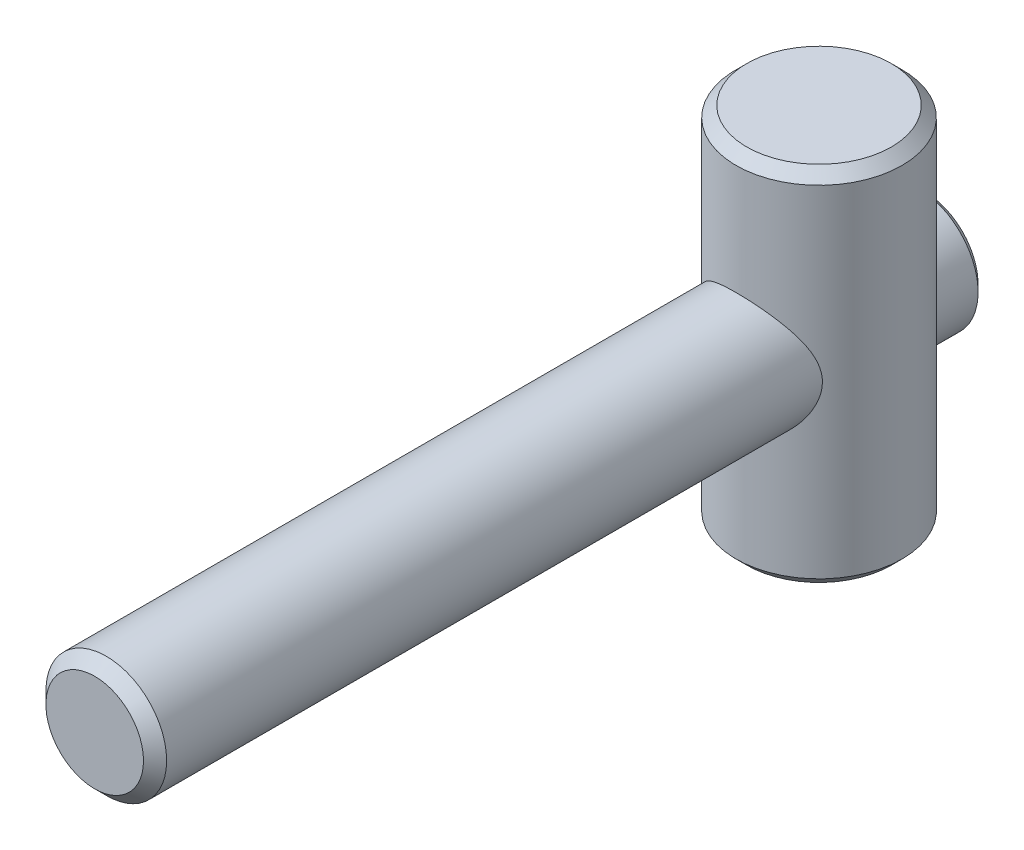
ISO-10303-21;
HEADER;
FILE_DESCRIPTION(('STEP AP214'),'2;1');
FILE_NAME('part.step','',(''),(''),'','','');
FILE_SCHEMA(('AUTOMOTIVE_DESIGN { 1 0 10303 214 1 1 1 1 }'));
ENDSEC;
DATA;
#1=APPLICATION_CONTEXT('core data for automotive mechanical design processes');
#2=APPLICATION_PROTOCOL_DEFINITION('international standard','automotive_design',2000,#1);
#3=PRODUCT_CONTEXT('',#1,'mechanical');
#4=PRODUCT('Part','Part','',(#3));
#5=PRODUCT_RELATED_PRODUCT_CATEGORY('part','',(#4));
#6=PRODUCT_DEFINITION_FORMATION('','',#4);
#7=PRODUCT_DEFINITION_CONTEXT('part definition',#1,'design');
#8=PRODUCT_DEFINITION('design','',#6,#7);
#9=PRODUCT_DEFINITION_SHAPE('','',#8);
#10=(LENGTH_UNIT() NAMED_UNIT(*) SI_UNIT(.MILLI.,.METRE.));
#11=(NAMED_UNIT(*) PLANE_ANGLE_UNIT() SI_UNIT($,.RADIAN.));
#12=(NAMED_UNIT(*) SI_UNIT($,.STERADIAN.) SOLID_ANGLE_UNIT());
#13=UNCERTAINTY_MEASURE_WITH_UNIT(LENGTH_MEASURE(1.E-05),#10,'distance_accuracy_value','');
#14=(GEOMETRIC_REPRESENTATION_CONTEXT(3) GLOBAL_UNCERTAINTY_ASSIGNED_CONTEXT((#13)) GLOBAL_UNIT_ASSIGNED_CONTEXT((#10,
#11,#12)) REPRESENTATION_CONTEXT('',''));
#15=CARTESIAN_POINT('',(0.,0.,0.));
#16=DIRECTION('',(0.,0.,1.));
#17=DIRECTION('',(1.,0.,0.));
#18=AXIS2_PLACEMENT_3D('',#15,#16,#17);
#19=CARTESIAN_POINT('',(0.,0.,-25.3));
#20=DIRECTION('',(0.,0.,1.));
#21=DIRECTION('',(1.,0.,0.));
#22=AXIS2_PLACEMENT_3D('',#19,#20,#21);
#23=PLANE('',#22);
#24=CARTESIAN_POINT('',(0.,0.,-25.3));
#25=DIRECTION('',(0.,0.,1.));
#26=DIRECTION('',(1.,0.,0.));
#27=AXIS2_PLACEMENT_3D('',#24,#25,#26);
#28=CIRCLE('',#27,3.54);
#29=CARTESIAN_POINT('',(-0.6,3.48878202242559,-25.3));
#30=VERTEX_POINT('',#29);
#31=CARTESIAN_POINT('',(-0.6,-3.48878202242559,-25.3));
#32=VERTEX_POINT('',#31);
#33=EDGE_CURVE('E239',#30,#32,#28,.T.);
#34=ORIENTED_EDGE('',*,*,#33,.F.);
#35=DIRECTION('',(0.,-1.,0.));
#36=VECTOR('',#35,1.);
#37=CARTESIAN_POINT('',(-0.6,0.,-25.3));
#38=LINE('',#37,#36);
#39=EDGE_CURVE('E228',#30,#32,#38,.T.);
#40=ORIENTED_EDGE('',*,*,#39,.T.);
#41=EDGE_LOOP('',(#34,#40));
#42=FACE_BOUND('',#41,.T.);
#43=ADVANCED_FACE('F14',(#42),#23,.F.);
#44=CARTESIAN_POINT('',(0.,0.,-25.3));
#45=DIRECTION('',(0.,0.,1.));
#46=DIRECTION('',(1.,0.,0.));
#47=AXIS2_PLACEMENT_3D('',#44,#45,#46);
#48=CONICAL_SURFACE('',#47,3.54,0.785398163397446);
#49=CARTESIAN_POINT('',(0.,0.,-24.84));
#50=DIRECTION('',(0.,0.,1.));
#51=DIRECTION('',(1.,0.,0.));
#52=AXIS2_PLACEMENT_3D('',#49,#50,#51);
#53=CIRCLE('',#52,4.);
#54=CARTESIAN_POINT('',(-0.6,3.95474398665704,-24.84));
#55=VERTEX_POINT('',#54);
#56=CARTESIAN_POINT('',(-0.6,-3.95474398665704,-24.84));
#57=VERTEX_POINT('',#56);
#58=EDGE_CURVE('E235',#55,#57,#53,.T.);
#59=ORIENTED_EDGE('',*,*,#58,.F.);
#60=CARTESIAN_POINT('',(-0.6,3.9554519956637,-24.8393));
#61=CARTESIAN_POINT('',(-0.6,3.83941046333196,-24.9540237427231));
#62=CARTESIAN_POINT('',(-0.6,3.72331727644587,-25.0686953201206));
#63=CARTESIAN_POINT('',(-0.6,3.49091447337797,-25.2979511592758));
#64=CARTESIAN_POINT('',(-0.6,3.37460477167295,-25.4125353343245));
#65=CARTESIAN_POINT('',(-0.6,3.14054409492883,-25.642725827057));
#66=CARTESIAN_POINT('',(-0.6,3.02279099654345,-25.7583299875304));
#67=CARTESIAN_POINT('',(-0.6,2.78706506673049,-25.9891808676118));
#68=CARTESIAN_POINT('',(-0.6,2.66909239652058,-26.1044277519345));
#69=CARTESIAN_POINT('',(-0.6,2.38769992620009,-26.3783597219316));
#70=CARTESIAN_POINT('',(-0.6,2.2240974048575,-26.536857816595));
#71=CARTESIAN_POINT('',(-0.6,1.97745696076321,-26.7736454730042));
#72=CARTESIAN_POINT('',(-0.6,1.89495476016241,-26.8524926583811));
#73=CARTESIAN_POINT('',(-0.6,1.72944434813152,-27.0096193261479));
#74=CARTESIAN_POINT('',(-0.6,1.64643625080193,-27.0878989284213));
#75=CARTESIAN_POINT('',(-0.6,1.48033289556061,-27.2429690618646));
#76=CARTESIAN_POINT('',(-0.6,1.39724415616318,-27.319766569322));
#77=CARTESIAN_POINT('',(-0.6,1.2297853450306,-27.4721053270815));
#78=CARTESIAN_POINT('',(-0.6,1.14541426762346,-27.5476454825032));
#79=CARTESIAN_POINT('',(-0.6,1.01743134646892,-27.6590099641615));
#80=CARTESIAN_POINT('',(-0.6,0.974611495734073,-27.6957423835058));
#81=CARTESIAN_POINT('',(-0.6,0.88825104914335,-27.7683476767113));
#82=CARTESIAN_POINT('',(-0.6,0.844710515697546,-27.8042206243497));
#83=CARTESIAN_POINT('',(-0.6,0.756681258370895,-27.8746657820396));
#84=CARTESIAN_POINT('',(-0.6,0.712193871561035,-27.9092396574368));
#85=CARTESIAN_POINT('',(-0.6,0.621791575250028,-27.9764590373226));
#86=CARTESIAN_POINT('',(-0.6,0.575877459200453,-28.0091055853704));
#87=CARTESIAN_POINT('',(-0.6,0.517059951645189,-28.0479937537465));
#88=CARTESIAN_POINT('',(-0.6,0.505142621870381,-28.0557273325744));
#89=CARTESIAN_POINT('',(-0.6,0.481156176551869,-28.0709583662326));
#90=CARTESIAN_POINT('',(-0.6,0.469087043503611,-28.0784557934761));
#91=CARTESIAN_POINT('',(-0.6,0.432629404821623,-28.1005451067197));
#92=CARTESIAN_POINT('',(-0.6,0.407992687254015,-28.1147326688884));
#93=CARTESIAN_POINT('',(-0.6,0.358127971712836,-28.1415606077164));
#94=CARTESIAN_POINT('',(-0.6,0.332906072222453,-28.1542121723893));
#95=CARTESIAN_POINT('',(-0.6,0.28159268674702,-28.1776006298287));
#96=CARTESIAN_POINT('',(-0.6,0.255501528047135,-28.1883382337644));
#97=CARTESIAN_POINT('',(-0.6,0.19385499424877,-28.2103112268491));
#98=CARTESIAN_POINT('',(-0.6,0.157946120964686,-28.2206034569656));
#99=CARTESIAN_POINT('',(-0.6,0.0849893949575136,-28.2350528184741));
#100=CARTESIAN_POINT('',(-0.6,0.0479465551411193,-28.2392338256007));
#101=CARTESIAN_POINT('',(-0.6,-0.0264554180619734,-28.2405737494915));
#102=CARTESIAN_POINT('',(-0.6,-0.0638152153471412,-28.237698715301));
#103=CARTESIAN_POINT('',(-0.6,-0.137530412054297,-28.2255268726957));
#104=CARTESIAN_POINT('',(-0.6,-0.173882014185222,-28.2162085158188));
#105=CARTESIAN_POINT('',(-0.6,-0.246261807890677,-28.1923675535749));
#106=CARTESIAN_POINT('',(-0.6,-0.282227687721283,-28.1776642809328));
#107=CARTESIAN_POINT('',(-0.6,-0.352560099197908,-28.1447807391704));
#108=CARTESIAN_POINT('',(-0.6,-0.386923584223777,-28.1265941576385));
#109=CARTESIAN_POINT('',(-0.6,-0.454569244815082,-28.0877625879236));
#110=CARTESIAN_POINT('',(-0.6,-0.487840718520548,-28.0670992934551));
#111=CARTESIAN_POINT('',(-0.6,-0.553299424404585,-28.024199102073));
#112=CARTESIAN_POINT('',(-0.6,-0.585487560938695,-28.0019635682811));
#113=CARTESIAN_POINT('',(-0.6,-0.651811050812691,-27.9544053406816));
#114=CARTESIAN_POINT('',(-0.6,-0.685873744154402,-27.928982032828));
#115=CARTESIAN_POINT('',(-0.6,-0.753285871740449,-27.8772035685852));
#116=CARTESIAN_POINT('',(-0.6,-0.786635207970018,-27.8508482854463));
#117=CARTESIAN_POINT('',(-0.6,-0.885905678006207,-27.7707557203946));
#118=CARTESIAN_POINT('',(-0.6,-0.951015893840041,-27.7160164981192));
#119=CARTESIAN_POINT('',(-0.6,-1.08003348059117,-27.6049240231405));
#120=CARTESIAN_POINT('',(-0.6,-1.14393845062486,-27.5485680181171));
#121=CARTESIAN_POINT('',(-0.6,-1.27086154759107,-27.4349047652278));
#122=CARTESIAN_POINT('',(-0.6,-1.3338799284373,-27.3775978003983));
#123=CARTESIAN_POINT('',(-0.6,-1.4591376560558,-27.2625095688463));
#124=CARTESIAN_POINT('',(-0.6,-1.52137875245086,-27.2047301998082));
#125=CARTESIAN_POINT('',(-0.6,-1.64544200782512,-27.0887149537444));
#126=CARTESIAN_POINT('',(-0.6,-1.70726413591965,-27.0304790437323));
#127=CARTESIAN_POINT('',(-0.6,-1.89214348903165,-26.8554033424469));
#128=CARTESIAN_POINT('',(-0.6,-2.01474045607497,-26.738078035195));
#129=CARTESIAN_POINT('',(-0.6,-2.28982158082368,-26.4732317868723));
#130=CARTESIAN_POINT('',(-0.6,-2.44210553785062,-26.3255035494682));
#131=CARTESIAN_POINT('',(-0.6,-2.74608630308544,-26.0293359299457));
#132=CARTESIAN_POINT('',(-0.6,-2.89778288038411,-25.8808963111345));
#133=CARTESIAN_POINT('',(-0.6,-3.20065551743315,-25.5837234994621));
#134=CARTESIAN_POINT('',(-0.6,-3.35183189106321,-25.4349906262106));
#135=CARTESIAN_POINT('',(-0.6,-3.653848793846,-25.1372979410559));
#136=CARTESIAN_POINT('',(-0.6,-3.80468942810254,-24.9883382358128));
#137=CARTESIAN_POINT('',(-0.6,-3.9554519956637,-24.8393));
#138=B_SPLINE_CURVE_WITH_KNOTS('',3,(#60,#61,#62,#63,#64,#65,#66,#67,#68,#69,#70,#71,#72,#73,
#74,#75,#76,#77,#78,#79,#80,#81,#82,#83,#84,#85,#86,#87,#88,#89,#90,#91,#92,#93,#94,#95,#96,#97,
#98,#99,#100,#101,#102,#103,#104,#105,#106,#107,#108,#109,#110,#111,#112,#113,#114,#115,#116,
#117,#118,#119,#120,#121,#122,#123,#124,#125,#126,#127,#128,#129,#130,#131,#132,#133,#134,#135,
#136,#137),.UNSPECIFIED.,.F.,.F.,(4,2,2,2,2,2,2,2,2,2,2,2,2,2,2,2,2,2,2,2,2,2,2,2,2,2,2,2,2,2,2,
2,2,2,2,2,2,2,4),(0.,0.489535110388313,0.979348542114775,1.47439453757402,1.96916156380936,
2.65251943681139,2.99487953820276,3.33716508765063,3.6765918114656,4.01630008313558,
4.18554223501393,4.35476980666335,4.5237724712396,4.69268277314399,4.73530049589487,
4.77792317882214,4.86317585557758,4.94776464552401,5.03232193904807,5.14397626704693,
5.25519319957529,5.36694631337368,5.47907498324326,5.5953739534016,5.71188570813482,
5.82931897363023,5.94665164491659,6.07414183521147,6.20164943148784,6.45678921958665,
6.71239265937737,6.96792134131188,7.22269628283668,7.47748980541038,7.98655823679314,
8.62305059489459,9.25977190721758,9.89599619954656,10.5319807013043),.UNSPECIFIED.);
#139=EDGE_CURVE('E221',#55,#30,#138,.T.);
#140=ORIENTED_EDGE('',*,*,#139,.T.);
#141=ORIENTED_EDGE('',*,*,#33,.T.);
#142=EDGE_CURVE('E229',#32,#57,#138,.T.);
#143=ORIENTED_EDGE('',*,*,#142,.T.);
#144=EDGE_LOOP('',(#59,#140,#141,#143));
#145=FACE_BOUND('',#144,.T.);
#146=ADVANCED_FACE('F215',(#145),#48,.T.);
#147=CARTESIAN_POINT('',(0.,0.,-12.8));
#148=DIRECTION('',(0.,0.,1.));
#149=DIRECTION('',(1.,0.,0.));
#150=AXIS2_PLACEMENT_3D('',#147,#148,#149);
#151=CYLINDRICAL_SURFACE('',#150,4.);
#152=CARTESIAN_POINT('',(4.,0.,-22.0749172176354));
#153=CARTESIAN_POINT('',(3.99999971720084,0.094559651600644,-22.0749177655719));
#154=CARTESIAN_POINT('',(3.99663873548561,0.189122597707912,-22.078488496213));
#155=CARTESIAN_POINT('',(3.98328406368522,0.377297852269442,-22.0925637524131));
#156=CARTESIAN_POINT('',(3.97328671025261,0.470909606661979,-22.1030721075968));
#157=CARTESIAN_POINT('',(3.94687649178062,0.65648336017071,-22.1304732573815));
#158=CARTESIAN_POINT('',(3.93044906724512,0.748441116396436,-22.1473805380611));
#159=CARTESIAN_POINT('',(3.89152450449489,0.929870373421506,-22.1867470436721));
#160=CARTESIAN_POINT('',(3.86902376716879,1.01934036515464,-22.2092095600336));
#161=CARTESIAN_POINT('',(3.79365509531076,1.28093397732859,-22.2828450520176));
#162=CARTESIAN_POINT('',(3.73252985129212,1.44885844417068,-22.3407009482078));
#163=CARTESIAN_POINT('',(3.590688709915,1.77146295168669,-22.4672506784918));
#164=CARTESIAN_POINT('',(3.50997431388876,1.92614400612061,-22.5359436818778));
#165=CARTESIAN_POINT('',(3.31318173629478,2.25065582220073,-22.6922095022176));
#166=CARTESIAN_POINT('',(3.19328494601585,2.41764951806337,-22.7808675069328));
#167=CARTESIAN_POINT('',(2.92908108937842,2.73178094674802,-22.9578760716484));
#168=CARTESIAN_POINT('',(2.78474090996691,2.87889125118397,-23.0462260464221));
#169=CARTESIAN_POINT('',(2.5362822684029,3.09553636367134,-23.1814353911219));
#170=CARTESIAN_POINT('',(2.43963284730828,3.17231415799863,-23.2305740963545));
#171=CARTESIAN_POINT('',(2.23844845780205,3.31733570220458,-23.3251054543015));
#172=CARTESIAN_POINT('',(2.13391712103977,3.38558334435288,-23.3704998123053));
#173=CARTESIAN_POINT('',(1.91752007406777,3.51266692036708,-23.4562228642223));
#174=CARTESIAN_POINT('',(1.80566515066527,3.57151627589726,-23.49655876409));
#175=CARTESIAN_POINT('',(1.57523382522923,3.67896799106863,-23.5709873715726));
#176=CARTESIAN_POINT('',(1.45666071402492,3.72757531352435,-23.6050831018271));
#177=CARTESIAN_POINT('',(1.16188171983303,3.83193503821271,-23.678830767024));
#178=CARTESIAN_POINT('',(0.982606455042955,3.88193864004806,-23.7146815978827));
#179=CARTESIAN_POINT('',(0.616370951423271,3.95663720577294,-23.7684829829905));
#180=CARTESIAN_POINT('',(0.429417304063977,3.98135342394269,-23.7864485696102));
#181=CARTESIAN_POINT('',(0.052567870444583,4.00411402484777,-23.8029868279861));
#182=CARTESIAN_POINT('',(-0.137333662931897,4.00209732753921,-23.8015150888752));
#183=CARTESIAN_POINT('',(-0.51380986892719,3.97135939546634,-23.7791958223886));
#184=CARTESIAN_POINT('',(-0.700383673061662,3.94263129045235,-23.7583433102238));
#185=CARTESIAN_POINT('',(-1.05962164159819,3.86136821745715,-23.699944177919));
#186=CARTESIAN_POINT('',(-1.23253206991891,3.80954610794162,-23.6628980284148));
#187=CARTESIAN_POINT('',(-1.56671343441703,3.68473335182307,-23.5749694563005));
#188=CARTESIAN_POINT('',(-1.72798199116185,3.61173839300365,-23.5240842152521));
#189=CARTESIAN_POINT('',(-2.05370310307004,3.43803005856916,-23.4054456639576));
#190=CARTESIAN_POINT('',(-2.2165364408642,3.33514439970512,-23.3364494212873));
#191=CARTESIAN_POINT('',(-2.52348319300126,3.10940476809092,-23.189889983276));
#192=CARTESIAN_POINT('',(-2.66757825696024,2.98653148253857,-23.1123185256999));
#193=CARTESIAN_POINT('',(-2.96150593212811,2.69807007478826,-22.9383041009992));
#194=CARTESIAN_POINT('',(-3.10726104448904,2.52879913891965,-22.8410685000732));
#195=CARTESIAN_POINT('',(-3.36953999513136,2.16705523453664,-22.6499971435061));
#196=CARTESIAN_POINT('',(-3.48605965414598,1.97457895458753,-22.556161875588));
#197=CARTESIAN_POINT('',(-3.66526169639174,1.61165125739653,-22.402032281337));
#198=CARTESIAN_POINT('',(-3.73414032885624,1.44549066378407,-22.3388789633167));
#199=CARTESIAN_POINT('',(-3.84985589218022,1.10068331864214,-22.2287430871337));
#200=CARTESIAN_POINT('',(-3.89674227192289,0.922065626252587,-22.1817243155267));
#201=CARTESIAN_POINT('',(-3.9599937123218,0.585461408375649,-22.1170906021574));
#202=CARTESIAN_POINT('',(-3.98009730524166,0.428880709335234,-22.0959235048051));
#203=CARTESIAN_POINT('',(-4.00152507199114,0.113064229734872,-22.0733369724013));
#204=CARTESIAN_POINT('',(-4.00286519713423,-0.0461691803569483,-22.0719007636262));
#205=CARTESIAN_POINT('',(-3.98669865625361,-0.362327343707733,-22.0889767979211));
#206=CARTESIAN_POINT('',(-3.96921589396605,-0.519254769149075,-22.1074637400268));
#207=CARTESIAN_POINT('',(-3.91666535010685,-0.82717652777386,-22.1614916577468));
#208=CARTESIAN_POINT('',(-3.88157034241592,-0.978161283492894,-22.1970590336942));
#209=CARTESIAN_POINT('',(-3.77812999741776,-1.33113055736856,-22.2978469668));
#210=CARTESIAN_POINT('',(-3.70207893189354,-1.52906623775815,-22.3692423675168));
#211=CARTESIAN_POINT('',(-3.52270580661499,-1.90640842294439,-22.5254840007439));
#212=CARTESIAN_POINT('',(-3.41932922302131,-2.08577687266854,-22.6103569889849));
#213=CARTESIAN_POINT('',(-3.18411833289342,-2.43025180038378,-22.7870574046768));
#214=CARTESIAN_POINT('',(-3.05152555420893,-2.59477148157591,-22.8790168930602));
#215=CARTESIAN_POINT('',(-2.76125147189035,-2.90173861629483,-23.059699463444));
#216=CARTESIAN_POINT('',(-2.6035911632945,-3.04420434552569,-23.1484251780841));
#217=CARTESIAN_POINT('',(-2.271539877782,-3.2987599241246,-23.3122631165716));
#218=CARTESIAN_POINT('',(-2.09818660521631,-3.41190835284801,-23.3878018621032));
#219=CARTESIAN_POINT('',(-1.82330793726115,-3.56180731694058,-23.4899086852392));
#220=CARTESIAN_POINT('',(-1.72916099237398,-3.6084863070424,-23.5220894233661));
#221=CARTESIAN_POINT('',(-1.53632285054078,-3.69470582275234,-23.5820343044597));
#222=CARTESIAN_POINT('',(-1.43763386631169,-3.73424977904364,-23.6098005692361));
#223=CARTESIAN_POINT('',(-1.23534308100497,-3.80598862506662,-23.6604944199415));
#224=CARTESIAN_POINT('',(-1.13170490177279,-3.83811376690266,-23.683375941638));
#225=CARTESIAN_POINT('',(-0.921160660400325,-3.89401032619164,-23.7233693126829));
#226=CARTESIAN_POINT('',(-0.81425636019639,-3.9177861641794,-23.7404842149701));
#227=CARTESIAN_POINT('',(-0.598125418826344,-3.95655048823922,-23.7684652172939));
#228=CARTESIAN_POINT('',(-0.488900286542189,-3.9715445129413,-23.7793352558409));
#229=CARTESIAN_POINT('',(-0.269138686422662,-3.9924605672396,-23.7945144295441));
#230=CARTESIAN_POINT('',(-0.15860243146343,-3.99838404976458,-23.7988246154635));
#231=CARTESIAN_POINT('',(0.0467313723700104,-4.00084937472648,-23.8006178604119));
#232=CARTESIAN_POINT('',(0.141509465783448,-3.99861635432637,-23.7989924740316));
#233=CARTESIAN_POINT('',(0.330490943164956,-3.98744748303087,-23.7908762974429));
#234=CARTESIAN_POINT('',(0.424694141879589,-3.97850957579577,-23.7843840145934));
#235=CARTESIAN_POINT('',(0.611759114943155,-3.95406659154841,-23.7666782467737));
#236=CARTESIAN_POINT('',(0.704621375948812,-3.93856396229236,-23.7554665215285));
#237=CARTESIAN_POINT('',(0.88841574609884,-3.90122128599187,-23.7285691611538));
#238=CARTESIAN_POINT('',(0.979347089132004,-3.87937877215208,-23.7128817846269));
#239=CARTESIAN_POINT('',(1.24445933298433,-3.80583624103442,-23.6603363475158));
#240=CARTESIAN_POINT('',(1.41518501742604,-3.74554675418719,-23.6175701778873));
#241=CARTESIAN_POINT('',(1.74369677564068,-3.60438289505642,-23.5191022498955));
#242=CARTESIAN_POINT('',(1.90148075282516,-3.5235051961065,-23.4633984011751));
#243=CARTESIAN_POINT('',(2.22228203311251,-3.33179335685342,-23.3343972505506));
#244=CARTESIAN_POINT('',(2.38322541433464,-3.21841054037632,-23.2597469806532));
#245=CARTESIAN_POINT('',(2.68497920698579,-2.97136345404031,-23.103106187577));
#246=CARTESIAN_POINT('',(2.82576198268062,-2.8376718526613,-23.0211058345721));
#247=CARTESIAN_POINT('',(3.03332548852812,-2.61000808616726,-22.8888332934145));
#248=CARTESIAN_POINT('',(3.10699576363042,-2.5218601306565,-22.839152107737));
#249=CARTESIAN_POINT('',(3.24665706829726,-2.3393224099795,-22.7403298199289));
#250=CARTESIAN_POINT('',(3.31264615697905,-2.24493107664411,-22.69118885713));
#251=CARTESIAN_POINT('',(3.43660180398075,-2.0501419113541,-22.5948719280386));
#252=CARTESIAN_POINT('',(3.49457298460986,-1.94974758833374,-22.5476948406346));
#253=CARTESIAN_POINT('',(3.6021255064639,-1.74306577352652,-22.4568795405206));
#254=CARTESIAN_POINT('',(3.6517073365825,-1.63677862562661,-22.4132411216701));
#255=CARTESIAN_POINT('',(3.76078752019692,-1.37275858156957,-22.3142162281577));
#256=CARTESIAN_POINT('',(3.81580236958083,-1.21205137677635,-22.2615166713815));
#257=CARTESIAN_POINT('',(3.88309107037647,-0.963817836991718,-22.1952018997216));
#258=CARTESIAN_POINT('',(3.90296834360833,-0.879972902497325,-22.1752342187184));
#259=CARTESIAN_POINT('',(3.93739985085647,-0.710192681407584,-22.1402454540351));
#260=CARTESIAN_POINT('',(3.95195647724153,-0.62425835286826,-22.1252221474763));
#261=CARTESIAN_POINT('',(3.97571410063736,-0.449073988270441,-22.1005263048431));
#262=CARTESIAN_POINT('',(3.98480070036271,-0.359792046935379,-22.0909682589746));
#263=CARTESIAN_POINT('',(3.99694447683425,-0.180341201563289,-22.0781627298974));
#264=CARTESIAN_POINT('',(4.00000026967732,-0.0901720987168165,-22.0749166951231));
#265=CARTESIAN_POINT('',(4.,0.,-22.0749172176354));
#266=B_SPLINE_CURVE_WITH_KNOTS('',3,(#152,#153,#154,#155,#156,#157,#158,#159,#160,#161,#162,
#163,#164,#165,#166,#167,#168,#169,#170,#171,#172,#173,#174,#175,#176,#177,#178,#179,#180,#181,
#182,#183,#184,#185,#186,#187,#188,#189,#190,#191,#192,#193,#194,#195,#196,#197,#198,#199,#200,
#201,#202,#203,#204,#205,#206,#207,#208,#209,#210,#211,#212,#213,#214,#215,#216,#217,#218,#219,
#220,#221,#222,#223,#224,#225,#226,#227,#228,#229,#230,#231,#232,#233,#234,#235,#236,#237,#238,
#239,#240,#241,#242,#243,#244,#245,#246,#247,#248,#249,#250,#251,#252,#253,#254,#255,#256,#257,
#258,#259,#260,#261,#262,#263,#264,#265),.UNSPECIFIED.,.T.,.F.,(4,2,2,2,2,2,2,2,2,2,2,2,2,2,2,2,
2,2,2,2,2,2,2,2,2,2,2,2,2,2,2,2,2,2,2,2,2,2,2,2,2,2,2,2,2,2,2,2,2,2,2,2,2,2,2,2,4),(0.,
0.283560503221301,0.567277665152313,0.851640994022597,1.13617321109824,1.69729774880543,
2.25837929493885,2.92774006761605,3.59801497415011,3.99610080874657,4.39400433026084,
4.79133442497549,5.18847154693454,5.75445889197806,6.31997012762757,6.88677367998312,
7.45372305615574,8.00426875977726,8.5549266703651,9.16646484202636,9.77859745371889,
10.5066073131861,11.2347211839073,11.8047550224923,12.3735009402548,12.8491941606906,
13.3244829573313,13.7991688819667,14.2745908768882,14.94214771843,15.6110467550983,
16.2999460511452,16.9882713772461,17.6463931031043,17.9757519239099,18.3049519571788,
18.6371312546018,18.9691344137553,19.3009279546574,19.6326683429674,19.9167672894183,
20.2009534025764,20.4850336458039,20.7692245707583,21.3249022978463,21.8806698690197,
22.5100347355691,23.1402542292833,23.5154020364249,23.8906444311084,24.2656695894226,
24.6406728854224,25.1720162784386,25.4371121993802,25.7020887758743,25.9724300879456,
26.24283342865),.UNSPECIFIED.);
#267=CARTESIAN_POINT('',(-0.6,3.95474398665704,-23.7671747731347));
#268=VERTEX_POINT('',#267);
#269=CARTESIAN_POINT('',(-0.6,-3.95474398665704,-23.7671747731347));
#270=VERTEX_POINT('',#269);
#271=EDGE_CURVE('E259',#268,#270,#266,.T.);
#272=ORIENTED_EDGE('',*,*,#271,.F.);
#273=DIRECTION('',(0.,0.,1.));
#274=VECTOR('',#273,1.);
#275=CARTESIAN_POINT('',(-0.6,3.95474398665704,-12.8));
#276=LINE('',#275,#274);
#277=EDGE_CURVE('E97',#268,#55,#276,.F.);
#278=ORIENTED_EDGE('',*,*,#277,.T.);
#279=ORIENTED_EDGE('',*,*,#58,.T.);
#280=DIRECTION('',(0.,0.,1.));
#281=VECTOR('',#280,1.);
#282=CARTESIAN_POINT('',(-0.6,-3.95474398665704,-12.8));
#283=LINE('',#282,#281);
#284=EDGE_CURVE('E244',#57,#270,#283,.T.);
#285=ORIENTED_EDGE('',*,*,#284,.T.);
#286=EDGE_LOOP('',(#272,#278,#279,#285));
#287=FACE_BOUND('',#286,.T.);
#288=ADVANCED_FACE('F196',(#287),#151,.T.);
#289=CARTESIAN_POINT('',(-0.6,0.,-54.8));
#290=DIRECTION('',(1.,0.,0.));
#291=DIRECTION('',(0.,-1.,0.));
#292=AXIS2_PLACEMENT_3D('',#289,#290,#291);
#293=CYLINDRICAL_SURFACE('',#292,31.5);
#294=CARTESIAN_POINT('',(0.7202,3.64052452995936,-23.5110789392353));
#295=CARTESIAN_POINT('',(0.629300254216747,3.66094254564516,-23.5134577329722));
#296=CARTESIAN_POINT('',(0.537517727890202,3.67749677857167,-23.515401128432));
#297=CARTESIAN_POINT('',(0.352855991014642,3.70277065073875,-23.5183807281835));
#298=CARTESIAN_POINT('',(0.259976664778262,3.71148945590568,-23.519416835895));
#299=CARTESIAN_POINT('',(0.0755266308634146,3.72089352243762,-23.5205345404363));
#300=CARTESIAN_POINT('',(-0.0160366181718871,3.7217239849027,-23.5206333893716));
#301=CARTESIAN_POINT('',(-0.198893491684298,3.71572448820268,-23.5199199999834));
#302=CARTESIAN_POINT('',(-0.290187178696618,3.70889647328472,-23.5191079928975));
#303=CARTESIAN_POINT('',(-0.438017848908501,3.69161294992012,-23.5170647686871));
#304=CARTESIAN_POINT('',(-0.494837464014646,3.68345523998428,-23.516102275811));
#305=CARTESIAN_POINT('',(-0.607946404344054,3.66419162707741,-23.5138403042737));
#306=CARTESIAN_POINT('',(-0.664235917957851,3.65308681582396,-23.5125409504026));
#307=CARTESIAN_POINT('',(-0.7202,3.64052452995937,-23.5110789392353));
#308=B_SPLINE_CURVE_WITH_KNOTS('',3,(#294,#295,#296,#297,#298,#299,#300,#301,#302,#303,#304,
#305,#306,#307),.UNSPECIFIED.,.F.,.F.,(4,2,2,2,2,2,4),(0.,0.279507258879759,0.559044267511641,
0.833425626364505,1.10773734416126,1.27989541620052,1.45198980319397),.UNSPECIFIED.);
#309=CARTESIAN_POINT('',(0.6,3.66517006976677,-23.5139563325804));
#310=VERTEX_POINT('',#309);
#311=CARTESIAN_POINT('',(-0.6,3.66517006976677,-23.5139563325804));
#312=VERTEX_POINT('',#311);
#313=EDGE_CURVE('E110',#310,#312,#308,.T.);
#314=ORIENTED_EDGE('',*,*,#313,.F.);
#315=CARTESIAN_POINT('',(0.6,0.,-54.8));
#316=DIRECTION('',(-1.,0.,0.));
#317=DIRECTION('',(0.,1.,0.));
#318=AXIS2_PLACEMENT_3D('',#315,#316,#317);
#319=CIRCLE('',#318,31.5);
#320=CARTESIAN_POINT('',(0.6,-3.66517006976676,-23.5139563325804));
#321=VERTEX_POINT('',#320);
#322=EDGE_CURVE('E119',#321,#310,#319,.T.);
#323=ORIENTED_EDGE('',*,*,#322,.F.);
#324=CARTESIAN_POINT('',(-0.7202,-3.64052452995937,-23.5110789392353));
#325=CARTESIAN_POINT('',(-0.629300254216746,-3.66094254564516,-23.5134577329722));
#326=CARTESIAN_POINT('',(-0.537517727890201,-3.67749677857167,-23.515401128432));
#327=CARTESIAN_POINT('',(-0.352855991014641,-3.70277065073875,-23.5183807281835));
#328=CARTESIAN_POINT('',(-0.259976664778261,-3.71148945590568,-23.519416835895));
#329=CARTESIAN_POINT('',(-0.0755266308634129,-3.72089352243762,-23.5205345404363));
#330=CARTESIAN_POINT('',(0.0160366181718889,-3.7217239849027,-23.5206333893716));
#331=CARTESIAN_POINT('',(0.1988934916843,-3.71572448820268,-23.5199199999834));
#332=CARTESIAN_POINT('',(0.29018717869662,-3.70889647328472,-23.5191079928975));
#333=CARTESIAN_POINT('',(0.438017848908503,-3.69161294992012,-23.5170647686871));
#334=CARTESIAN_POINT('',(0.494837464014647,-3.68345523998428,-23.516102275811));
#335=CARTESIAN_POINT('',(0.607946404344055,-3.66419162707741,-23.5138403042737));
#336=CARTESIAN_POINT('',(0.664235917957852,-3.65308681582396,-23.5125409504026));
#337=CARTESIAN_POINT('',(0.7202,-3.64052452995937,-23.5110789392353));
#338=B_SPLINE_CURVE_WITH_KNOTS('',3,(#324,#325,#326,#327,#328,#329,#330,#331,#332,#333,#334,
#335,#336,#337),.UNSPECIFIED.,.F.,.F.,(4,2,2,2,2,2,4),(0.,0.279507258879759,0.559044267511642,
0.833425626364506,1.10773734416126,1.27989541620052,1.45198980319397),.UNSPECIFIED.);
#339=CARTESIAN_POINT('',(-0.6,-3.66517006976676,-23.5139563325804));
#340=VERTEX_POINT('',#339);
#341=EDGE_CURVE('E102',#340,#321,#338,.T.);
#342=ORIENTED_EDGE('',*,*,#341,.F.);
#343=CARTESIAN_POINT('',(-0.6,0.,-54.8));
#344=DIRECTION('',(-1.,0.,0.));
#345=DIRECTION('',(0.,1.,0.));
#346=AXIS2_PLACEMENT_3D('',#343,#344,#345);
#347=CIRCLE('',#346,31.5);
#348=EDGE_CURVE('E19',#340,#312,#347,.T.);
#349=ORIENTED_EDGE('',*,*,#348,.T.);
#350=EDGE_LOOP('',(#314,#323,#342,#349));
#351=FACE_BOUND('',#350,.T.);
#352=ADVANCED_FACE('F191',(#351),#293,.F.);
#353=DIRECTION('',(0.,-1.,0.));
#354=VECTOR('',#353,1.);
#355=CARTESIAN_POINT('',(0.6,0.,-25.3));
#356=LINE('',#355,#354);
#357=CARTESIAN_POINT('',(0.6,3.48878202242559,-25.3));
#358=VERTEX_POINT('',#357);
#359=CARTESIAN_POINT('',(0.6,-3.48878202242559,-25.3));
#360=VERTEX_POINT('',#359);
#361=EDGE_CURVE('E212',#358,#360,#356,.T.);
#362=ORIENTED_EDGE('',*,*,#361,.F.);
#363=EDGE_CURVE('E236',#360,#358,#28,.T.);
#364=ORIENTED_EDGE('',*,*,#363,.F.);
#365=EDGE_LOOP('',(#362,#364));
#366=FACE_BOUND('',#365,.T.);
#367=ADVANCED_FACE('F195',(#366),#23,.F.);
#368=CARTESIAN_POINT('',(0.6,3.9554519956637,-24.8393));
#369=CARTESIAN_POINT('',(0.6,3.83941046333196,-24.9540237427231));
#370=CARTESIAN_POINT('',(0.6,3.72331727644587,-25.0686953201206));
#371=CARTESIAN_POINT('',(0.6,3.49091447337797,-25.2979511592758));
#372=CARTESIAN_POINT('',(0.6,3.37460477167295,-25.4125353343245));
#373=CARTESIAN_POINT('',(0.6,3.14054409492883,-25.642725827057));
#374=CARTESIAN_POINT('',(0.6,3.02279099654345,-25.7583299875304));
#375=CARTESIAN_POINT('',(0.6,2.78706506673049,-25.9891808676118));
#376=CARTESIAN_POINT('',(0.6,2.66909239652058,-26.1044277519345));
#377=CARTESIAN_POINT('',(0.6,2.38769992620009,-26.3783597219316));
#378=CARTESIAN_POINT('',(0.6,2.2240974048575,-26.536857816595));
#379=CARTESIAN_POINT('',(0.6,1.97745696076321,-26.7736454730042));
#380=CARTESIAN_POINT('',(0.6,1.89495476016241,-26.8524926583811));
#381=CARTESIAN_POINT('',(0.6,1.72944434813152,-27.0096193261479));
#382=CARTESIAN_POINT('',(0.6,1.64643625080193,-27.0878989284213));
#383=CARTESIAN_POINT('',(0.6,1.48033289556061,-27.2429690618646));
#384=CARTESIAN_POINT('',(0.6,1.39724415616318,-27.319766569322));
#385=CARTESIAN_POINT('',(0.6,1.2297853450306,-27.4721053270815));
#386=CARTESIAN_POINT('',(0.6,1.14541426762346,-27.5476454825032));
#387=CARTESIAN_POINT('',(0.6,1.01743134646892,-27.6590099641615));
#388=CARTESIAN_POINT('',(0.6,0.974611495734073,-27.6957423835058));
#389=CARTESIAN_POINT('',(0.6,0.88825104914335,-27.7683476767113));
#390=CARTESIAN_POINT('',(0.6,0.844710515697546,-27.8042206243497));
#391=CARTESIAN_POINT('',(0.6,0.756681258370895,-27.8746657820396));
#392=CARTESIAN_POINT('',(0.6,0.712193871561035,-27.9092396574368));
#393=CARTESIAN_POINT('',(0.6,0.621791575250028,-27.9764590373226));
#394=CARTESIAN_POINT('',(0.6,0.575877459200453,-28.0091055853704));
#395=CARTESIAN_POINT('',(0.6,0.517059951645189,-28.0479937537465));
#396=CARTESIAN_POINT('',(0.6,0.505142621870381,-28.0557273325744));
#397=CARTESIAN_POINT('',(0.6,0.481156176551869,-28.0709583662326));
#398=CARTESIAN_POINT('',(0.6,0.469087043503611,-28.0784557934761));
#399=CARTESIAN_POINT('',(0.6,0.432629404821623,-28.1005451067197));
#400=CARTESIAN_POINT('',(0.6,0.407992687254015,-28.1147326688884));
#401=CARTESIAN_POINT('',(0.6,0.358127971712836,-28.1415606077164));
#402=CARTESIAN_POINT('',(0.6,0.332906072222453,-28.1542121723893));
#403=CARTESIAN_POINT('',(0.6,0.28159268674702,-28.1776006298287));
#404=CARTESIAN_POINT('',(0.6,0.255501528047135,-28.1883382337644));
#405=CARTESIAN_POINT('',(0.6,0.19385499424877,-28.2103112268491));
#406=CARTESIAN_POINT('',(0.6,0.157946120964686,-28.2206034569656));
#407=CARTESIAN_POINT('',(0.6,0.0849893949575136,-28.2350528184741));
#408=CARTESIAN_POINT('',(0.6,0.0479465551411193,-28.2392338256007));
#409=CARTESIAN_POINT('',(0.6,-0.0264554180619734,-28.2405737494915));
#410=CARTESIAN_POINT('',(0.6,-0.0638152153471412,-28.237698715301));
#411=CARTESIAN_POINT('',(0.6,-0.137530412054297,-28.2255268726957));
#412=CARTESIAN_POINT('',(0.6,-0.173882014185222,-28.2162085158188));
#413=CARTESIAN_POINT('',(0.6,-0.246261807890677,-28.1923675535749));
#414=CARTESIAN_POINT('',(0.6,-0.282227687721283,-28.1776642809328));
#415=CARTESIAN_POINT('',(0.6,-0.352560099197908,-28.1447807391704));
#416=CARTESIAN_POINT('',(0.6,-0.386923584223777,-28.1265941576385));
#417=CARTESIAN_POINT('',(0.6,-0.454569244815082,-28.0877625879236));
#418=CARTESIAN_POINT('',(0.6,-0.487840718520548,-28.0670992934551));
#419=CARTESIAN_POINT('',(0.6,-0.553299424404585,-28.024199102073));
#420=CARTESIAN_POINT('',(0.6,-0.585487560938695,-28.0019635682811));
#421=CARTESIAN_POINT('',(0.6,-0.651811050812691,-27.9544053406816));
#422=CARTESIAN_POINT('',(0.6,-0.685873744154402,-27.928982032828));
#423=CARTESIAN_POINT('',(0.6,-0.753285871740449,-27.8772035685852));
#424=CARTESIAN_POINT('',(0.6,-0.786635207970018,-27.8508482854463));
#425=CARTESIAN_POINT('',(0.6,-0.885905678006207,-27.7707557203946));
#426=CARTESIAN_POINT('',(0.6,-0.951015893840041,-27.7160164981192));
#427=CARTESIAN_POINT('',(0.6,-1.08003348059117,-27.6049240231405));
#428=CARTESIAN_POINT('',(0.6,-1.14393845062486,-27.5485680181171));
#429=CARTESIAN_POINT('',(0.6,-1.27086154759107,-27.4349047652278));
#430=CARTESIAN_POINT('',(0.6,-1.3338799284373,-27.3775978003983));
#431=CARTESIAN_POINT('',(0.6,-1.4591376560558,-27.2625095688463));
#432=CARTESIAN_POINT('',(0.6,-1.52137875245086,-27.2047301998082));
#433=CARTESIAN_POINT('',(0.6,-1.64544200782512,-27.0887149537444));
#434=CARTESIAN_POINT('',(0.6,-1.70726413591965,-27.0304790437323));
#435=CARTESIAN_POINT('',(0.6,-1.89214348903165,-26.8554033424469));
#436=CARTESIAN_POINT('',(0.6,-2.01474045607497,-26.738078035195));
#437=CARTESIAN_POINT('',(0.6,-2.28982158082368,-26.4732317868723));
#438=CARTESIAN_POINT('',(0.6,-2.44210553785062,-26.3255035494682));
#439=CARTESIAN_POINT('',(0.6,-2.74608630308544,-26.0293359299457));
#440=CARTESIAN_POINT('',(0.6,-2.89778288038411,-25.8808963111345));
#441=CARTESIAN_POINT('',(0.6,-3.20065551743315,-25.5837234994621));
#442=CARTESIAN_POINT('',(0.6,-3.35183189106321,-25.4349906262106));
#443=CARTESIAN_POINT('',(0.6,-3.653848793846,-25.1372979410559));
#444=CARTESIAN_POINT('',(0.6,-3.80468942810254,-24.9883382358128));
#445=CARTESIAN_POINT('',(0.6,-3.9554519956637,-24.8393));
#446=B_SPLINE_CURVE_WITH_KNOTS('',3,(#368,#369,#370,#371,#372,#373,#374,#375,#376,#377,#378,
#379,#380,#381,#382,#383,#384,#385,#386,#387,#388,#389,#390,#391,#392,#393,#394,#395,#396,#397,
#398,#399,#400,#401,#402,#403,#404,#405,#406,#407,#408,#409,#410,#411,#412,#413,#414,#415,#416,
#417,#418,#419,#420,#421,#422,#423,#424,#425,#426,#427,#428,#429,#430,#431,#432,#433,#434,#435,
#436,#437,#438,#439,#440,#441,#442,#443,#444,#445),.UNSPECIFIED.,.F.,.F.,(4,2,2,2,2,2,2,2,2,2,2,
2,2,2,2,2,2,2,2,2,2,2,2,2,2,2,2,2,2,2,2,2,2,2,2,2,2,2,4),(0.,0.489535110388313,
0.979348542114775,1.47439453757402,1.96916156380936,2.65251943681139,2.99487953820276,
3.33716508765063,3.6765918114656,4.01630008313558,4.18554223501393,4.35476980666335,
4.5237724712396,4.69268277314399,4.73530049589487,4.77792317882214,4.86317585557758,
4.94776464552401,5.03232193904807,5.14397626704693,5.25519319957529,5.36694631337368,
5.47907498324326,5.5953739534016,5.71188570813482,5.82931897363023,5.94665164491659,
6.07414183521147,6.20164943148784,6.45678921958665,6.71239265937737,6.96792134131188,
7.22269628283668,7.47748980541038,7.98655823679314,8.62305059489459,9.25977190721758,
9.89599619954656,10.5319807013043),.UNSPECIFIED.);
#447=CARTESIAN_POINT('',(0.6,3.95474398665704,-24.84));
#448=VERTEX_POINT('',#447);
#449=EDGE_CURVE('E36',#448,#358,#446,.T.);
#450=ORIENTED_EDGE('',*,*,#449,.F.);
#451=CARTESIAN_POINT('',(0.6,-3.95474398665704,-24.84));
#452=VERTEX_POINT('',#451);
#453=EDGE_CURVE('E232',#452,#448,#53,.T.);
#454=ORIENTED_EDGE('',*,*,#453,.F.);
#455=EDGE_CURVE('E213',#360,#452,#446,.T.);
#456=ORIENTED_EDGE('',*,*,#455,.F.);
#457=ORIENTED_EDGE('',*,*,#363,.T.);
#458=EDGE_LOOP('',(#450,#454,#456,#457));
#459=FACE_BOUND('',#458,.T.);
#460=ADVANCED_FACE('F219',(#459),#48,.T.);
#461=CARTESIAN_POINT('',(0.6,-3.95474398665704,-23.7671747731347));
#462=VERTEX_POINT('',#461);
#463=CARTESIAN_POINT('',(0.6,3.95474398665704,-23.7671747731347));
#464=VERTEX_POINT('',#463);
#465=EDGE_CURVE('E263',#462,#464,#266,.T.);
#466=ORIENTED_EDGE('',*,*,#465,.F.);
#467=DIRECTION('',(0.,0.,1.));
#468=VECTOR('',#467,1.);
#469=CARTESIAN_POINT('',(0.6,-3.95474398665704,-12.8));
#470=LINE('',#469,#468);
#471=EDGE_CURVE('E242',#452,#462,#470,.T.);
#472=ORIENTED_EDGE('',*,*,#471,.F.);
#473=ORIENTED_EDGE('',*,*,#453,.T.);
#474=DIRECTION('',(0.,0.,1.));
#475=VECTOR('',#474,1.);
#476=CARTESIAN_POINT('',(0.6,3.95474398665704,-12.8));
#477=LINE('',#476,#475);
#478=EDGE_CURVE('E32',#464,#448,#477,.F.);
#479=ORIENTED_EDGE('',*,*,#478,.F.);
#480=EDGE_LOOP('',(#466,#472,#473,#479));
#481=FACE_BOUND('',#480,.T.);
#482=ADVANCED_FACE('F203',(#481),#151,.T.);
#483=CARTESIAN_POINT('',(0.6,0.,-54.8));
#484=DIRECTION('',(-1.,0.,0.));
#485=DIRECTION('',(0.,1.,0.));
#486=AXIS2_PLACEMENT_3D('',#483,#484,#485);
#487=PLANE('',#486);
#488=CARTESIAN_POINT('',(0.6,5.24144856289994,-25.0756784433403));
#489=CARTESIAN_POINT('',(0.6,4.98335054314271,-24.8193092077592));
#490=CARTESIAN_POINT('',(0.6,4.72517898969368,-24.5630130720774));
#491=CARTESIAN_POINT('',(0.6,4.20843297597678,-24.0508330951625));
#492=CARTESIAN_POINT('',(0.6,3.94985852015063,-23.7949492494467));
#493=CARTESIAN_POINT('',(0.6,3.56149681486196,-23.411626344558));
#494=CARTESIAN_POINT('',(0.6,3.43195870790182,-23.2839350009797));
#495=CARTESIAN_POINT('',(0.6,3.17264289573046,-23.0287963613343));
#496=CARTESIAN_POINT('',(0.6,3.04286519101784,-22.9013490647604));
#497=CARTESIAN_POINT('',(0.6,2.78297398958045,-22.6467936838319));
#498=CARTESIAN_POINT('',(0.6,2.65286048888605,-22.5196856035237));
#499=CARTESIAN_POINT('',(0.6,2.39209410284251,-22.2660223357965));
#500=CARTESIAN_POINT('',(0.6,2.26144121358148,-22.139467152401));
#501=CARTESIAN_POINT('',(0.6,2.13041700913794,-22.0132954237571));
#502=B_SPLINE_CURVE_WITH_KNOTS('',3,(#488,#489,#490,#491,#492,#493,#494,#495,#496,#497,#498,
#499,#500,#501),.UNSPECIFIED.,.F.,.F.,(4,2,2,2,2,2,4),(0.,1.09135708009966,2.18270221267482,
2.72838208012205,3.27406081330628,3.81974602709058,4.36543520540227),.UNSPECIFIED.);
#503=CARTESIAN_POINT('',(0.6,3.92153996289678,-23.7671747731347));
#504=VERTEX_POINT('',#503);
#505=EDGE_CURVE('E169',#504,#310,#502,.T.);
#506=ORIENTED_EDGE('',*,*,#505,.F.);
#507=DIRECTION('',(0.,1.,0.));
#508=VECTOR('',#507,1.);
#509=CARTESIAN_POINT('',(0.6,12.,-23.7671747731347));
#510=LINE('',#509,#508);
#511=EDGE_CURVE('E117',#504,#464,#510,.T.);
#512=ORIENTED_EDGE('',*,*,#511,.T.);
#513=ORIENTED_EDGE('',*,*,#478,.T.);
#514=ORIENTED_EDGE('',*,*,#449,.T.);
#515=ORIENTED_EDGE('',*,*,#361,.T.);
#516=ORIENTED_EDGE('',*,*,#455,.T.);
#517=ORIENTED_EDGE('',*,*,#471,.T.);
#518=CARTESIAN_POINT('',(0.6,-3.92153996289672,-23.7671747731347));
#519=VERTEX_POINT('',#518);
#520=EDGE_CURVE('E248',#462,#519,#510,.T.);
#521=ORIENTED_EDGE('',*,*,#520,.T.);
#522=CARTESIAN_POINT('',(0.6,-2.13041700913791,-22.0132954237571));
#523=CARTESIAN_POINT('',(0.6,-2.20825937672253,-22.088230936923));
#524=CARTESIAN_POINT('',(0.6,-2.2859592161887,-22.1633140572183));
#525=CARTESIAN_POINT('',(0.6,-2.44113254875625,-22.3137133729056));
#526=CARTESIAN_POINT('',(0.6,-2.51860604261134,-22.3890295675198));
#527=CARTESIAN_POINT('',(0.6,-2.75077459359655,-22.6152340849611));
#528=CARTESIAN_POINT('',(0.6,-2.90521897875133,-22.7663795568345));
#529=CARTESIAN_POINT('',(0.6,-3.21369228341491,-23.06908955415));
#530=CARTESIAN_POINT('',(0.6,-3.36772120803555,-23.2206540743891));
#531=CARTESIAN_POINT('',(0.6,-3.67550250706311,-23.524064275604));
#532=CARTESIAN_POINT('',(0.6,-3.82925488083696,-23.6759099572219));
#533=CARTESIAN_POINT('',(0.6,-4.19294614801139,-24.0355407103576));
#534=CARTESIAN_POINT('',(0.6,-4.40280249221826,-24.2434092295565));
#535=CARTESIAN_POINT('',(0.6,-4.82227635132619,-24.6593903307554));
#536=CARTESIAN_POINT('',(0.6,-5.03189386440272,-24.8675029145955));
#537=CARTESIAN_POINT('',(0.6,-5.24144856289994,-25.0756784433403));
#538=B_SPLINE_CURVE_WITH_KNOTS('',3,(#522,#523,#524,#525,#526,#527,#528,#529,#530,#531,#532,
#533,#534,#535,#536,#537),.UNSPECIFIED.,.F.,.F.,(4,2,2,2,2,2,2,4),(0.,0.324148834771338,
0.64829658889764,1.29658684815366,1.94486909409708,2.59315282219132,3.47929086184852,
4.36543562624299),.UNSPECIFIED.);
#539=EDGE_CURVE('E160',#321,#519,#538,.T.);
#540=ORIENTED_EDGE('',*,*,#539,.F.);
#541=ORIENTED_EDGE('',*,*,#322,.T.);
#542=EDGE_LOOP('',(#506,#512,#513,#514,#515,#516,#517,#521,#540,#541));
#543=FACE_BOUND('',#542,.T.);
#544=ADVANCED_FACE('F199',(#543),#487,.T.);
#545=CARTESIAN_POINT('',(-0.6,0.,-54.8));
#546=DIRECTION('',(-1.,0.,0.));
#547=DIRECTION('',(0.,1.,0.));
#548=AXIS2_PLACEMENT_3D('',#545,#546,#547);
#549=PLANE('',#548);
#550=DIRECTION('',(0.,1.,0.));
#551=VECTOR('',#550,1.);
#552=CARTESIAN_POINT('',(-0.6,12.,-23.7671747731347));
#553=LINE('',#552,#551);
#554=CARTESIAN_POINT('',(-0.6,3.92153996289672,-23.7671747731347));
#555=VERTEX_POINT('',#554);
#556=EDGE_CURVE('E91',#555,#268,#553,.T.);
#557=ORIENTED_EDGE('',*,*,#556,.F.);
#558=CARTESIAN_POINT('',(-0.6,5.24144856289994,-25.0756784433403));
#559=CARTESIAN_POINT('',(-0.6,4.98335054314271,-24.8193092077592));
#560=CARTESIAN_POINT('',(-0.6,4.72517898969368,-24.5630130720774));
#561=CARTESIAN_POINT('',(-0.6,4.20843297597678,-24.0508330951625));
#562=CARTESIAN_POINT('',(-0.6,3.94985852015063,-23.7949492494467));
#563=CARTESIAN_POINT('',(-0.6,3.56149681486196,-23.411626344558));
#564=CARTESIAN_POINT('',(-0.6,3.43195870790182,-23.2839350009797));
#565=CARTESIAN_POINT('',(-0.6,3.17264289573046,-23.0287963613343));
#566=CARTESIAN_POINT('',(-0.6,3.04286519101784,-22.9013490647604));
#567=CARTESIAN_POINT('',(-0.6,2.78297398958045,-22.6467936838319));
#568=CARTESIAN_POINT('',(-0.6,2.65286048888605,-22.5196856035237));
#569=CARTESIAN_POINT('',(-0.6,2.39209410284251,-22.2660223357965));
#570=CARTESIAN_POINT('',(-0.6,2.26144121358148,-22.1394671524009));
#571=CARTESIAN_POINT('',(-0.6,2.13041700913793,-22.0132954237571));
#572=B_SPLINE_CURVE_WITH_KNOTS('',3,(#558,#559,#560,#561,#562,#563,#564,#565,#566,#567,#568,
#569,#570,#571),.UNSPECIFIED.,.F.,.F.,(4,2,2,2,2,2,4),(0.,1.09135708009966,2.18270221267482,
2.72838208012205,3.27406081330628,3.81974602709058,4.36543520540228),.UNSPECIFIED.);
#573=EDGE_CURVE('E94',#555,#312,#572,.T.);
#574=ORIENTED_EDGE('',*,*,#573,.T.);
#575=ORIENTED_EDGE('',*,*,#348,.F.);
#576=CARTESIAN_POINT('',(-0.6,-2.13041700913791,-22.0132954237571));
#577=CARTESIAN_POINT('',(-0.6,-2.20825937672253,-22.088230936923));
#578=CARTESIAN_POINT('',(-0.6,-2.2859592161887,-22.1633140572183));
#579=CARTESIAN_POINT('',(-0.6,-2.44113254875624,-22.3137133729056));
#580=CARTESIAN_POINT('',(-0.6,-2.51860604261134,-22.3890295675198));
#581=CARTESIAN_POINT('',(-0.6,-2.75077459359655,-22.6152340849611));
#582=CARTESIAN_POINT('',(-0.6,-2.90521897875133,-22.7663795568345));
#583=CARTESIAN_POINT('',(-0.6,-3.21369228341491,-23.06908955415));
#584=CARTESIAN_POINT('',(-0.6,-3.36772120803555,-23.2206540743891));
#585=CARTESIAN_POINT('',(-0.6,-3.67550250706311,-23.524064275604));
#586=CARTESIAN_POINT('',(-0.6,-3.82925488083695,-23.6759099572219));
#587=CARTESIAN_POINT('',(-0.6,-4.19294614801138,-24.0355407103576));
#588=CARTESIAN_POINT('',(-0.6,-4.40280249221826,-24.2434092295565));
#589=CARTESIAN_POINT('',(-0.6,-4.82227635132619,-24.6593903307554));
#590=CARTESIAN_POINT('',(-0.6,-5.03189386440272,-24.8675029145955));
#591=CARTESIAN_POINT('',(-0.6,-5.24144856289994,-25.0756784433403));
#592=B_SPLINE_CURVE_WITH_KNOTS('',3,(#576,#577,#578,#579,#580,#581,#582,#583,#584,#585,#586,
#587,#588,#589,#590,#591),.UNSPECIFIED.,.F.,.F.,(4,2,2,2,2,2,2,4),(0.,0.324148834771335,
0.648296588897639,1.29658684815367,1.94486909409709,2.59315282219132,3.47929086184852,
4.36543562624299),.UNSPECIFIED.);
#593=CARTESIAN_POINT('',(-0.6,-3.92153996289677,-23.7671747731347));
#594=VERTEX_POINT('',#593);
#595=EDGE_CURVE('E175',#340,#594,#592,.T.);
#596=ORIENTED_EDGE('',*,*,#595,.T.);
#597=EDGE_CURVE('E104',#270,#594,#553,.T.);
#598=ORIENTED_EDGE('',*,*,#597,.F.);
#599=ORIENTED_EDGE('',*,*,#284,.F.);
#600=ORIENTED_EDGE('',*,*,#142,.F.);
#601=ORIENTED_EDGE('',*,*,#39,.F.);
#602=ORIENTED_EDGE('',*,*,#139,.F.);
#603=ORIENTED_EDGE('',*,*,#277,.F.);
#604=EDGE_LOOP('',(#557,#574,#575,#596,#598,#599,#600,#601,#602,#603));
#605=FACE_BOUND('',#604,.T.);
#606=ADVANCED_FACE('F16',(#605),#549,.F.);
#607=CARTESIAN_POINT('',(4.,0.,-14.5250827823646));
#608=CARTESIAN_POINT('',(3.99999971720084,-0.0945596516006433,-14.5250822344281));
#609=CARTESIAN_POINT('',(3.99663873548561,-0.189122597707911,-14.521511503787));
#610=CARTESIAN_POINT('',(3.98328406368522,-0.37729785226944,-14.5074362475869));
#611=CARTESIAN_POINT('',(3.97328671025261,-0.470909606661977,-14.4969278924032));
#612=CARTESIAN_POINT('',(3.94687649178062,-0.65648336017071,-14.4695267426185));
#613=CARTESIAN_POINT('',(3.93044906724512,-0.748441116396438,-14.4526194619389));
#614=CARTESIAN_POINT('',(3.89152450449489,-0.929870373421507,-14.4132529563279));
#615=CARTESIAN_POINT('',(3.86902376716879,-1.01934036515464,-14.3907904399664));
#616=CARTESIAN_POINT('',(3.79365509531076,-1.28093397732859,-14.3171549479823));
#617=CARTESIAN_POINT('',(3.73252985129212,-1.44885844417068,-14.2592990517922));
#618=CARTESIAN_POINT('',(3.590688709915,-1.7714629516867,-14.1327493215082));
#619=CARTESIAN_POINT('',(3.50997431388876,-1.92614400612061,-14.0640563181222));
#620=CARTESIAN_POINT('',(3.31318173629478,-2.25065582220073,-13.9077904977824));
#621=CARTESIAN_POINT('',(3.19328494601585,-2.41764951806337,-13.8191324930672));
#622=CARTESIAN_POINT('',(2.92908108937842,-2.73178094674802,-13.6421239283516));
#623=CARTESIAN_POINT('',(2.78474090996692,-2.87889125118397,-13.5537739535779));
#624=CARTESIAN_POINT('',(2.53628226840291,-3.09553636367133,-13.4185646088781));
#625=CARTESIAN_POINT('',(2.43963284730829,-3.17231415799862,-13.3694259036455));
#626=CARTESIAN_POINT('',(2.23844845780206,-3.31733570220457,-13.2748945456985));
#627=CARTESIAN_POINT('',(2.13391712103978,-3.38558334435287,-13.2295001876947));
#628=CARTESIAN_POINT('',(1.91752007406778,-3.51266692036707,-13.1437771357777));
#629=CARTESIAN_POINT('',(1.80566515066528,-3.57151627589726,-13.10344123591));
#630=CARTESIAN_POINT('',(1.57523382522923,-3.67896799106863,-13.0290126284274));
#631=CARTESIAN_POINT('',(1.45666071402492,-3.72757531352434,-12.9949168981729));
#632=CARTESIAN_POINT('',(1.16188171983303,-3.83193503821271,-12.921169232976));
#633=CARTESIAN_POINT('',(0.982606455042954,-3.88193864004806,-12.8853184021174));
#634=CARTESIAN_POINT('',(0.616370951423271,-3.95663720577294,-12.8315170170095));
#635=CARTESIAN_POINT('',(0.429417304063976,-3.98135342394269,-12.8135514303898));
#636=CARTESIAN_POINT('',(0.0525678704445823,-4.00411402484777,-12.7970131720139));
#637=CARTESIAN_POINT('',(-0.137333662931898,-4.00209732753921,-12.7984849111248));
#638=CARTESIAN_POINT('',(-0.51380986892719,-3.97135939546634,-12.8208041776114));
#639=CARTESIAN_POINT('',(-0.700383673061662,-3.94263129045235,-12.8416566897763));
#640=CARTESIAN_POINT('',(-1.05962164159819,-3.86136821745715,-12.900055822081));
#641=CARTESIAN_POINT('',(-1.23253206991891,-3.80954610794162,-12.9371019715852));
#642=CARTESIAN_POINT('',(-1.56671343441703,-3.68473335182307,-13.0250305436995));
#643=CARTESIAN_POINT('',(-1.72798199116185,-3.61173839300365,-13.0759157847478));
#644=CARTESIAN_POINT('',(-2.05370310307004,-3.43803005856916,-13.1945543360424));
#645=CARTESIAN_POINT('',(-2.2165364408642,-3.33514439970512,-13.2635505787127));
#646=CARTESIAN_POINT('',(-2.52348319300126,-3.10940476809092,-13.410110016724));
#647=CARTESIAN_POINT('',(-2.66757825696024,-2.98653148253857,-13.4876814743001));
#648=CARTESIAN_POINT('',(-2.96150593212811,-2.69807007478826,-13.6616958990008));
#649=CARTESIAN_POINT('',(-3.10726104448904,-2.52879913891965,-13.7589314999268));
#650=CARTESIAN_POINT('',(-3.36953999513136,-2.16705523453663,-13.9500028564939));
#651=CARTESIAN_POINT('',(-3.48605965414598,-1.97457895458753,-14.043838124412));
#652=CARTESIAN_POINT('',(-3.66526169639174,-1.61165125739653,-14.197967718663));
#653=CARTESIAN_POINT('',(-3.73414032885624,-1.44549066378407,-14.2611210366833));
#654=CARTESIAN_POINT('',(-3.84985589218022,-1.10068331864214,-14.3712569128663));
#655=CARTESIAN_POINT('',(-3.8967422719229,-0.922065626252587,-14.4182756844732));
#656=CARTESIAN_POINT('',(-3.95999371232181,-0.585461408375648,-14.4829093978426));
#657=CARTESIAN_POINT('',(-3.98009730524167,-0.428880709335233,-14.5040764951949));
#658=CARTESIAN_POINT('',(-4.00152507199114,-0.113064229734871,-14.5266630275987));
#659=CARTESIAN_POINT('',(-4.00286519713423,0.0461691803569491,-14.5280992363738));
#660=CARTESIAN_POINT('',(-3.98669865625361,0.362327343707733,-14.5110232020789));
#661=CARTESIAN_POINT('',(-3.96921589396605,0.519254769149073,-14.4925362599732));
#662=CARTESIAN_POINT('',(-3.91666535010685,0.827176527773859,-14.4385083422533));
#663=CARTESIAN_POINT('',(-3.88157034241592,0.978161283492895,-14.4029409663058));
#664=CARTESIAN_POINT('',(-3.77812999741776,1.33113055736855,-14.3021530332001));
#665=CARTESIAN_POINT('',(-3.70207893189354,1.52906623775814,-14.2307576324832));
#666=CARTESIAN_POINT('',(-3.522705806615,1.90640842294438,-14.0745159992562));
#667=CARTESIAN_POINT('',(-3.41932922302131,2.08577687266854,-13.9896430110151));
#668=CARTESIAN_POINT('',(-3.18411833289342,2.43025180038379,-13.8129425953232));
#669=CARTESIAN_POINT('',(-3.05152555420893,2.59477148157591,-13.7209831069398));
#670=CARTESIAN_POINT('',(-2.76125147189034,2.90173861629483,-13.540300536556));
#671=CARTESIAN_POINT('',(-2.6035911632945,3.04420434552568,-13.4515748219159));
#672=CARTESIAN_POINT('',(-2.271539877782,3.2987599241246,-13.2877368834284));
#673=CARTESIAN_POINT('',(-2.09818660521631,3.41190835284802,-13.2121981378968));
#674=CARTESIAN_POINT('',(-1.82330793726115,3.56180731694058,-13.1100913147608));
#675=CARTESIAN_POINT('',(-1.72916099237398,3.6084863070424,-13.0779105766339));
#676=CARTESIAN_POINT('',(-1.53632285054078,3.69470582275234,-13.0179656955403));
#677=CARTESIAN_POINT('',(-1.43763386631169,3.73424977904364,-12.990199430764));
#678=CARTESIAN_POINT('',(-1.23534308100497,3.80598862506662,-12.9395055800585));
#679=CARTESIAN_POINT('',(-1.13170490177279,3.83811376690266,-12.916624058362));
#680=CARTESIAN_POINT('',(-0.921160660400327,3.89401032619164,-12.8766306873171));
#681=CARTESIAN_POINT('',(-0.814256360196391,3.9177861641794,-12.8595157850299));
#682=CARTESIAN_POINT('',(-0.598125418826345,3.95655048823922,-12.8315347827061));
#683=CARTESIAN_POINT('',(-0.488900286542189,3.9715445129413,-12.8206647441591));
#684=CARTESIAN_POINT('',(-0.269138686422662,3.9924605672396,-12.8054855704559));
#685=CARTESIAN_POINT('',(-0.158602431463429,3.99838404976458,-12.8011753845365));
#686=CARTESIAN_POINT('',(0.046731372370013,4.00084937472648,-12.7993821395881));
#687=CARTESIAN_POINT('',(0.141509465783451,3.99861635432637,-12.8010075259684));
#688=CARTESIAN_POINT('',(0.330490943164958,3.98744748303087,-12.8091237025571));
#689=CARTESIAN_POINT('',(0.424694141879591,3.97850957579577,-12.8156159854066));
#690=CARTESIAN_POINT('',(0.611759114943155,3.95406659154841,-12.8333217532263));
#691=CARTESIAN_POINT('',(0.704621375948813,3.93856396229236,-12.8445334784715));
#692=CARTESIAN_POINT('',(0.88841574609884,3.90122128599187,-12.8714308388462));
#693=CARTESIAN_POINT('',(0.979347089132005,3.87937877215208,-12.8871182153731));
#694=CARTESIAN_POINT('',(1.24445933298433,3.80583624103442,-12.9396636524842));
#695=CARTESIAN_POINT('',(1.41518501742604,3.74554675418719,-12.9824298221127));
#696=CARTESIAN_POINT('',(1.74369677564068,3.60438289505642,-13.0808977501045));
#697=CARTESIAN_POINT('',(1.90148075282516,3.5235051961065,-13.1366015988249));
#698=CARTESIAN_POINT('',(2.22228203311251,3.33179335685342,-13.2656027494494));
#699=CARTESIAN_POINT('',(2.38322541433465,3.21841054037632,-13.3402530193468));
#700=CARTESIAN_POINT('',(2.68497920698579,2.97136345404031,-13.496893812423));
#701=CARTESIAN_POINT('',(2.82576198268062,2.8376718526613,-13.5788941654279));
#702=CARTESIAN_POINT('',(3.03332548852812,2.61000808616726,-13.7111667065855));
#703=CARTESIAN_POINT('',(3.10699576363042,2.5218601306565,-13.760847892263));
#704=CARTESIAN_POINT('',(3.24665706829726,2.33932240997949,-13.8596701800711));
#705=CARTESIAN_POINT('',(3.31264615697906,2.24493107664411,-13.9088111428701));
#706=CARTESIAN_POINT('',(3.43660180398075,2.05014191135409,-14.0051280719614));
#707=CARTESIAN_POINT('',(3.49457298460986,1.94974758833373,-14.0523051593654));
#708=CARTESIAN_POINT('',(3.60212550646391,1.74306577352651,-14.1431204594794));
#709=CARTESIAN_POINT('',(3.65170733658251,1.6367786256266,-14.18675887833));
#710=CARTESIAN_POINT('',(3.76078752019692,1.37275858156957,-14.2857837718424));
#711=CARTESIAN_POINT('',(3.81580236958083,1.21205137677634,-14.3384833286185));
#712=CARTESIAN_POINT('',(3.88309107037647,0.963817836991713,-14.4047981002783));
#713=CARTESIAN_POINT('',(3.90296834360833,0.879972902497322,-14.4247657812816));
#714=CARTESIAN_POINT('',(3.93739985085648,0.71019268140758,-14.4597545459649));
#715=CARTESIAN_POINT('',(3.95195647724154,0.624258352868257,-14.4747778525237));
#716=CARTESIAN_POINT('',(3.97571410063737,0.449073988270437,-14.4994736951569));
#717=CARTESIAN_POINT('',(3.98480070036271,0.359792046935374,-14.5090317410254));
#718=CARTESIAN_POINT('',(3.99694447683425,0.180341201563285,-14.5218372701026));
#719=CARTESIAN_POINT('',(4.00000026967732,0.0901720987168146,-14.525083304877));
#720=CARTESIAN_POINT('',(4.,0.,-14.5250827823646));
#721=B_SPLINE_CURVE_WITH_KNOTS('',3,(#607,#608,#609,#610,#611,#612,#613,#614,#615,#616,#617,
#618,#619,#620,#621,#622,#623,#624,#625,#626,#627,#628,#629,#630,#631,#632,#633,#634,#635,#636,
#637,#638,#639,#640,#641,#642,#643,#644,#645,#646,#647,#648,#649,#650,#651,#652,#653,#654,#655,
#656,#657,#658,#659,#660,#661,#662,#663,#664,#665,#666,#667,#668,#669,#670,#671,#672,#673,#674,
#675,#676,#677,#678,#679,#680,#681,#682,#683,#684,#685,#686,#687,#688,#689,#690,#691,#692,#693,
#694,#695,#696,#697,#698,#699,#700,#701,#702,#703,#704,#705,#706,#707,#708,#709,#710,#711,#712,
#713,#714,#715,#716,#717,#718,#719,#720),.UNSPECIFIED.,.T.,.F.,(4,2,2,2,2,2,2,2,2,2,2,2,2,2,2,2,
2,2,2,2,2,2,2,2,2,2,2,2,2,2,2,2,2,2,2,2,2,2,2,2,2,2,2,2,2,2,2,2,2,2,2,2,2,2,2,2,4),(0.,
0.2835605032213,0.567277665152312,0.851640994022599,1.13617321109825,1.69729774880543,
2.25837929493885,2.92774006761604,3.59801497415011,3.99610080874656,4.39400433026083,
4.79133442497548,5.18847154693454,5.75445889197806,6.31997012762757,6.88677367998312,
7.45372305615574,8.00426875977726,8.5549266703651,9.16646484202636,9.77859745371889,
10.5066073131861,11.2347211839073,11.8047550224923,12.3735009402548,12.8491941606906,
13.3244829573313,13.7991688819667,14.2745908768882,14.94214771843,15.6110467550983,
16.2999460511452,16.9882713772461,17.6463931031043,17.9757519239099,18.3049519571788,
18.6371312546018,18.9691344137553,19.3009279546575,19.6326683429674,19.9167672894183,
20.2009534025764,20.4850336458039,20.7692245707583,21.3249022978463,21.8806698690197,
22.5100347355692,23.1402542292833,23.5154020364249,23.8906444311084,24.2656695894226,
24.6406728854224,25.1720162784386,25.4371121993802,25.7020887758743,25.9724300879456,
26.24283342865),.UNSPECIFIED.);
#722=CARTESIAN_POINT('',(4.,0.,-14.5250827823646));
#723=VERTEX_POINT('',#722);
#724=EDGE_CURVE('E185',#723,#723,#721,.T.);
#725=ORIENTED_EDGE('',*,*,#724,.F.);
#726=EDGE_LOOP('',(#725));
#727=FACE_BOUND('',#726,.T.);
#728=CARTESIAN_POINT('',(0.,0.,28.933));
#729=DIRECTION('',(0.,0.,1.));
#730=DIRECTION('',(1.,0.,0.));
#731=AXIS2_PLACEMENT_3D('',#728,#729,#730);
#732=CIRCLE('',#731,4.);
#733=CARTESIAN_POINT('',(4.,0.,28.933));
#734=VERTEX_POINT('',#733);
#735=EDGE_CURVE('E264',#734,#734,#732,.T.);
#736=ORIENTED_EDGE('',*,*,#735,.F.);
#737=EDGE_LOOP('',(#736));
#738=FACE_BOUND('',#737,.T.);
#739=ADVANCED_FACE('F277',(#727,#738),#151,.T.);
#740=CARTESIAN_POINT('',(0.,-12.,-18.3));
#741=DIRECTION('',(0.,1.,0.));
#742=DIRECTION('',(1.,0.,0.));
#743=AXIS2_PLACEMENT_3D('',#740,#741,#742);
#744=PLANE('',#743);
#745=CARTESIAN_POINT('',(0.,-12.,-18.3));
#746=DIRECTION('',(0.,1.,0.));
#747=DIRECTION('',(1.,0.,0.));
#748=AXIS2_PLACEMENT_3D('',#745,#746,#747);
#749=CIRCLE('',#748,4.79289321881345);
#750=CARTESIAN_POINT('',(4.79289321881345,-12.,-18.3));
#751=VERTEX_POINT('',#750);
#752=EDGE_CURVE('E122',#751,#751,#749,.T.);
#753=ORIENTED_EDGE('',*,*,#752,.F.);
#754=EDGE_LOOP('',(#753));
#755=FACE_BOUND('',#754,.T.);
#756=ADVANCED_FACE('F286',(#755),#744,.F.);
#757=CARTESIAN_POINT('',(0.,12.,-23.0928932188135));
#758=DIRECTION('',(0.,-1.,0.));
#759=DIRECTION('',(-1.,0.,0.));
#760=AXIS2_PLACEMENT_3D('',#757,#758,#759);
#761=PLANE('',#760);
#762=CARTESIAN_POINT('',(0.,12.,-18.3));
#763=DIRECTION('',(0.,1.,0.));
#764=DIRECTION('',(1.,0.,0.));
#765=AXIS2_PLACEMENT_3D('',#762,#763,#764);
#766=CIRCLE('',#765,4.79289321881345);
#767=CARTESIAN_POINT('',(4.79289321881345,12.,-18.3));
#768=VERTEX_POINT('',#767);
#769=EDGE_CURVE('E9',#768,#768,#766,.T.);
#770=ORIENTED_EDGE('',*,*,#769,.T.);
#771=EDGE_LOOP('',(#770));
#772=FACE_BOUND('',#771,.T.);
#773=ADVANCED_FACE('F152',(#772),#761,.F.);
#774=CARTESIAN_POINT('',(0.,-12.,-18.3));
#775=DIRECTION('',(0.,1.,0.));
#776=DIRECTION('',(1.,0.,0.));
#777=AXIS2_PLACEMENT_3D('',#774,#775,#776);
#778=CONICAL_SURFACE('',#777,4.79289321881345,0.78539816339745);
#779=CARTESIAN_POINT('',(0.,-11.2928932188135,-18.3));
#780=DIRECTION('',(0.,1.,0.));
#781=DIRECTION('',(1.,0.,0.));
#782=AXIS2_PLACEMENT_3D('',#779,#780,#781);
#783=CIRCLE('',#782,5.5);
#784=CARTESIAN_POINT('',(5.5,-11.2928932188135,-18.3));
#785=VERTEX_POINT('',#784);
#786=EDGE_CURVE('E308',#785,#785,#783,.T.);
#787=ORIENTED_EDGE('',*,*,#786,.F.);
#788=EDGE_LOOP('',(#787));
#789=FACE_BOUND('',#788,.T.);
#790=ORIENTED_EDGE('',*,*,#752,.T.);
#791=EDGE_LOOP('',(#790));
#792=FACE_BOUND('',#791,.T.);
#793=ADVANCED_FACE('F294',(#789,#792),#778,.T.);
#794=CARTESIAN_POINT('',(0.,11.2928932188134,-18.3));
#795=DIRECTION('',(0.,-1.,0.));
#796=DIRECTION('',(-1.,0.,0.));
#797=AXIS2_PLACEMENT_3D('',#794,#795,#796);
#798=CONICAL_SURFACE('',#797,5.5,0.785398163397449);
#799=ORIENTED_EDGE('',*,*,#769,.F.);
#800=EDGE_LOOP('',(#799));
#801=FACE_BOUND('',#800,.T.);
#802=CARTESIAN_POINT('',(0.,11.2928932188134,-18.3));
#803=DIRECTION('',(0.,1.,0.));
#804=DIRECTION('',(1.,0.,0.));
#805=AXIS2_PLACEMENT_3D('',#802,#803,#804);
#806=CIRCLE('',#805,5.5);
#807=CARTESIAN_POINT('',(5.5,11.2928932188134,-18.3));
#808=VERTEX_POINT('',#807);
#809=EDGE_CURVE('E24',#808,#808,#806,.T.);
#810=ORIENTED_EDGE('',*,*,#809,.T.);
#811=EDGE_LOOP('',(#810));
#812=FACE_BOUND('',#811,.T.);
#813=ADVANCED_FACE('F298',(#801,#812),#798,.T.);
#814=CARTESIAN_POINT('',(0.,12.,-18.3));
#815=DIRECTION('',(0.,1.,0.));
#816=DIRECTION('',(1.,0.,0.));
#817=AXIS2_PLACEMENT_3D('',#814,#815,#816);
#818=CYLINDRICAL_SURFACE('',#817,5.5);
#819=ORIENTED_EDGE('',*,*,#809,.F.);
#820=EDGE_LOOP('',(#819));
#821=FACE_BOUND('',#820,.T.);
#822=ORIENTED_EDGE('',*,*,#786,.T.);
#823=EDGE_LOOP('',(#822));
#824=FACE_BOUND('',#823,.T.);
#825=ORIENTED_EDGE('',*,*,#271,.T.);
#826=ORIENTED_EDGE('',*,*,#597,.T.);
#827=CARTESIAN_POINT('',(2.17144416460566,-2.81248297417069,-23.3532));
#828=CARTESIAN_POINT('',(2.0690833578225,-2.94700705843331,-23.3971442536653));
#829=CARTESIAN_POINT('',(1.95731490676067,-3.07515187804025,-23.4415267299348));
#830=CARTESIAN_POINT('',(1.7139524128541,-3.31452488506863,-23.5277451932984));
#831=CARTESIAN_POINT('',(1.58217918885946,-3.42557978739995,-23.5695528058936));
#832=CARTESIAN_POINT('',(1.32837400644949,-3.6037499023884,-23.6384435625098));
#833=CARTESIAN_POINT('',(1.20977987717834,-3.67520879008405,-23.6667936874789));
#834=CARTESIAN_POINT('',(0.962048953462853,-3.79911511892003,-23.716673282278));
#835=CARTESIAN_POINT('',(0.832947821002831,-3.85162383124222,-23.7382247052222));
#836=CARTESIAN_POINT('',(0.565167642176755,-3.93463497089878,-23.7725623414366));
#837=CARTESIAN_POINT('',(0.426406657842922,-3.96491514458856,-23.7852599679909));
#838=CARTESIAN_POINT('',(0.145054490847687,-3.99975612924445,-23.7998860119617));
#839=CARTESIAN_POINT('',(0.00246399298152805,-4.00432150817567,-23.8018163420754));
#840=CARTESIAN_POINT('',(-0.262063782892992,-3.98843613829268,-23.7951349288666));
#841=CARTESIAN_POINT('',(-0.384245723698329,-3.97120385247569,-23.7878793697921));
#842=CARTESIAN_POINT('',(-0.623772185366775,-3.91837802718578,-23.7658368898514));
#843=CARTESIAN_POINT('',(-0.741117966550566,-3.88278930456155,-23.751051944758));
#844=CARTESIAN_POINT('',(-0.970983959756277,-3.79456515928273,-23.7148909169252));
#845=CARTESIAN_POINT('',(-1.08334691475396,-3.74158084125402,-23.6933804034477));
#846=CARTESIAN_POINT('',(-1.29927135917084,-3.62137345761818,-23.6454803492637));
#847=CARTESIAN_POINT('',(-1.40281265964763,-3.5541188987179,-23.6190800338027));
#848=CARTESIAN_POINT('',(-1.62977930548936,-3.38608908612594,-23.5546775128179));
#849=CARTESIAN_POINT('',(-1.7498929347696,-3.28130382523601,-23.5155665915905));
#850=CARTESIAN_POINT('',(-1.97310720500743,-3.05696742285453,-23.4352436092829));
#851=CARTESIAN_POINT('',(-2.07631088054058,-2.93751410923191,-23.3940464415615));
#852=CARTESIAN_POINT('',(-2.17144416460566,-2.81248297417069,-23.3532));
#853=B_SPLINE_CURVE_WITH_KNOTS('',3,(#827,#828,#829,#830,#831,#832,#833,#834,#835,#836,#837,
#838,#839,#840,#841,#842,#843,#844,#845,#846,#847,#848,#849,#850,#851,#852),.UNSPECIFIED.,.F.,
.F.,(4,2,2,2,2,2,2,2,2,2,2,2,4),(0.,0.524750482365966,1.05451352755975,1.47691569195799,
1.89793961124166,2.32311787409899,2.74822060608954,3.11728330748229,3.48624921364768,
3.86312036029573,4.24083204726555,4.73148267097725,5.21902256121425),.UNSPECIFIED.);
#854=EDGE_CURVE('E118',#519,#594,#853,.T.);
#855=ORIENTED_EDGE('',*,*,#854,.F.);
#856=ORIENTED_EDGE('',*,*,#520,.F.);
#857=ORIENTED_EDGE('',*,*,#465,.T.);
#858=ORIENTED_EDGE('',*,*,#511,.F.);
#859=CARTESIAN_POINT('',(-2.17144416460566,2.81248297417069,-23.3532));
#860=CARTESIAN_POINT('',(-2.0690833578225,2.94700705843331,-23.3971442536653));
#861=CARTESIAN_POINT('',(-1.95731490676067,3.07515187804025,-23.4415267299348));
#862=CARTESIAN_POINT('',(-1.7139524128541,3.31452488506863,-23.5277451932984));
#863=CARTESIAN_POINT('',(-1.58217918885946,3.42557978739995,-23.5695528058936));
#864=CARTESIAN_POINT('',(-1.32837400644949,3.6037499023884,-23.6384435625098));
#865=CARTESIAN_POINT('',(-1.20977987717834,3.67520879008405,-23.6667936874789));
#866=CARTESIAN_POINT('',(-0.962048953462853,3.79911511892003,-23.716673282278));
#867=CARTESIAN_POINT('',(-0.832947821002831,3.85162383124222,-23.7382247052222));
#868=CARTESIAN_POINT('',(-0.565167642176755,3.93463497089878,-23.7725623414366));
#869=CARTESIAN_POINT('',(-0.426406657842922,3.96491514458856,-23.7852599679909));
#870=CARTESIAN_POINT('',(-0.145054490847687,3.99975612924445,-23.7998860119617));
#871=CARTESIAN_POINT('',(-0.00246399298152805,4.00432150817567,-23.8018163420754));
#872=CARTESIAN_POINT('',(0.262063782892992,3.98843613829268,-23.7951349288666));
#873=CARTESIAN_POINT('',(0.384245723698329,3.97120385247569,-23.7878793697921));
#874=CARTESIAN_POINT('',(0.623772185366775,3.91837802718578,-23.7658368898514));
#875=CARTESIAN_POINT('',(0.741117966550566,3.88278930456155,-23.751051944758));
#876=CARTESIAN_POINT('',(0.970983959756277,3.79456515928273,-23.7148909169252));
#877=CARTESIAN_POINT('',(1.08334691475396,3.74158084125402,-23.6933804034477));
#878=CARTESIAN_POINT('',(1.29927135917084,3.62137345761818,-23.6454803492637));
#879=CARTESIAN_POINT('',(1.40281265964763,3.5541188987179,-23.6190800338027));
#880=CARTESIAN_POINT('',(1.62977930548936,3.38608908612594,-23.5546775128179));
#881=CARTESIAN_POINT('',(1.7498929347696,3.28130382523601,-23.5155665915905));
#882=CARTESIAN_POINT('',(1.97310720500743,3.05696742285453,-23.4352436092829));
#883=CARTESIAN_POINT('',(2.07631088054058,2.93751410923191,-23.3940464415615));
#884=CARTESIAN_POINT('',(2.17144416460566,2.81248297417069,-23.3532));
#885=B_SPLINE_CURVE_WITH_KNOTS('',3,(#859,#860,#861,#862,#863,#864,#865,#866,#867,#868,#869,
#870,#871,#872,#873,#874,#875,#876,#877,#878,#879,#880,#881,#882,#883,#884),.UNSPECIFIED.,.F.,
.F.,(4,2,2,2,2,2,2,2,2,2,2,2,4),(0.,0.524750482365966,1.05451352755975,1.47691569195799,
1.89793961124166,2.32311787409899,2.74822060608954,3.11728330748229,3.48624921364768,
3.86312036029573,4.24083204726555,4.73148267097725,5.21902256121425),.UNSPECIFIED.);
#886=EDGE_CURVE('E108',#555,#504,#885,.T.);
#887=ORIENTED_EDGE('',*,*,#886,.F.);
#888=ORIENTED_EDGE('',*,*,#556,.T.);
#889=EDGE_LOOP('',(#825,#826,#855,#856,#857,#858,#887,#888));
#890=FACE_BOUND('',#889,.T.);
#891=ORIENTED_EDGE('',*,*,#724,.T.);
#892=EDGE_LOOP('',(#891));
#893=FACE_BOUND('',#892,.T.);
#894=ADVANCED_FACE('F114',(#821,#824,#890,#893),#818,.T.);
#895=CARTESIAN_POINT('',(0.,0.,-23.8));
#896=DIRECTION('',(0.,0.,-1.));
#897=DIRECTION('',(-1.,0.,0.));
#898=AXIS2_PLACEMENT_3D('',#895,#896,#897);
#899=CONICAL_SURFACE('',#898,4.,0.785398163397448);
#900=ORIENTED_EDGE('',*,*,#595,.F.);
#901=ORIENTED_EDGE('',*,*,#341,.T.);
#902=ORIENTED_EDGE('',*,*,#539,.T.);
#903=ORIENTED_EDGE('',*,*,#854,.T.);
#904=EDGE_LOOP('',(#900,#901,#902,#903));
#905=FACE_BOUND('',#904,.T.);
#906=ADVANCED_FACE('F151',(#905),#899,.F.);
#907=ORIENTED_EDGE('',*,*,#573,.F.);
#908=ORIENTED_EDGE('',*,*,#886,.T.);
#909=ORIENTED_EDGE('',*,*,#505,.T.);
#910=ORIENTED_EDGE('',*,*,#313,.T.);
#911=EDGE_LOOP('',(#907,#908,#909,#910));
#912=FACE_BOUND('',#911,.T.);
#913=ADVANCED_FACE('F107',(#912),#899,.F.);
#914=CARTESIAN_POINT('',(3.233,0.,29.7));
#915=DIRECTION('',(0.,0.,-1.));
#916=DIRECTION('',(-1.,0.,0.));
#917=AXIS2_PLACEMENT_3D('',#914,#915,#916);
#918=PLANE('',#917);
#919=CARTESIAN_POINT('',(0.,0.,29.7));
#920=DIRECTION('',(0.,0.,1.));
#921=DIRECTION('',(1.,0.,0.));
#922=AXIS2_PLACEMENT_3D('',#919,#920,#921);
#923=CIRCLE('',#922,3.233);
#924=CARTESIAN_POINT('',(3.233,0.,29.7));
#925=VERTEX_POINT('',#924);
#926=EDGE_CURVE('E266',#925,#925,#923,.T.);
#927=ORIENTED_EDGE('',*,*,#926,.T.);
#928=EDGE_LOOP('',(#927));
#929=FACE_BOUND('',#928,.T.);
#930=ADVANCED_FACE('F150',(#929),#918,.F.);
#931=CARTESIAN_POINT('',(0.,0.,28.933));
#932=DIRECTION('',(0.,0.,-1.));
#933=DIRECTION('',(-1.,0.,0.));
#934=AXIS2_PLACEMENT_3D('',#931,#932,#933);
#935=CONICAL_SURFACE('',#934,4.,0.785398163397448);
#936=ORIENTED_EDGE('',*,*,#926,.F.);
#937=EDGE_LOOP('',(#936));
#938=FACE_BOUND('',#937,.T.);
#939=ORIENTED_EDGE('',*,*,#735,.T.);
#940=EDGE_LOOP('',(#939));
#941=FACE_BOUND('',#940,.T.);
#942=ADVANCED_FACE('F274',(#938,#941),#935,.T.);
#943=CLOSED_SHELL('',(#43,#146,#288,#352,#367,#460,#482,#544,#606,#739,#756,#773,#793,#813,#894,
#906,#913,#930,#942));
#944=MANIFOLD_SOLID_BREP('B1',#943);
#945=ADVANCED_BREP_SHAPE_REPRESENTATION('',(#18,#944),#14);
#946=SHAPE_DEFINITION_REPRESENTATION(#9,#945);
ENDSEC;
END-ISO-10303-21;
